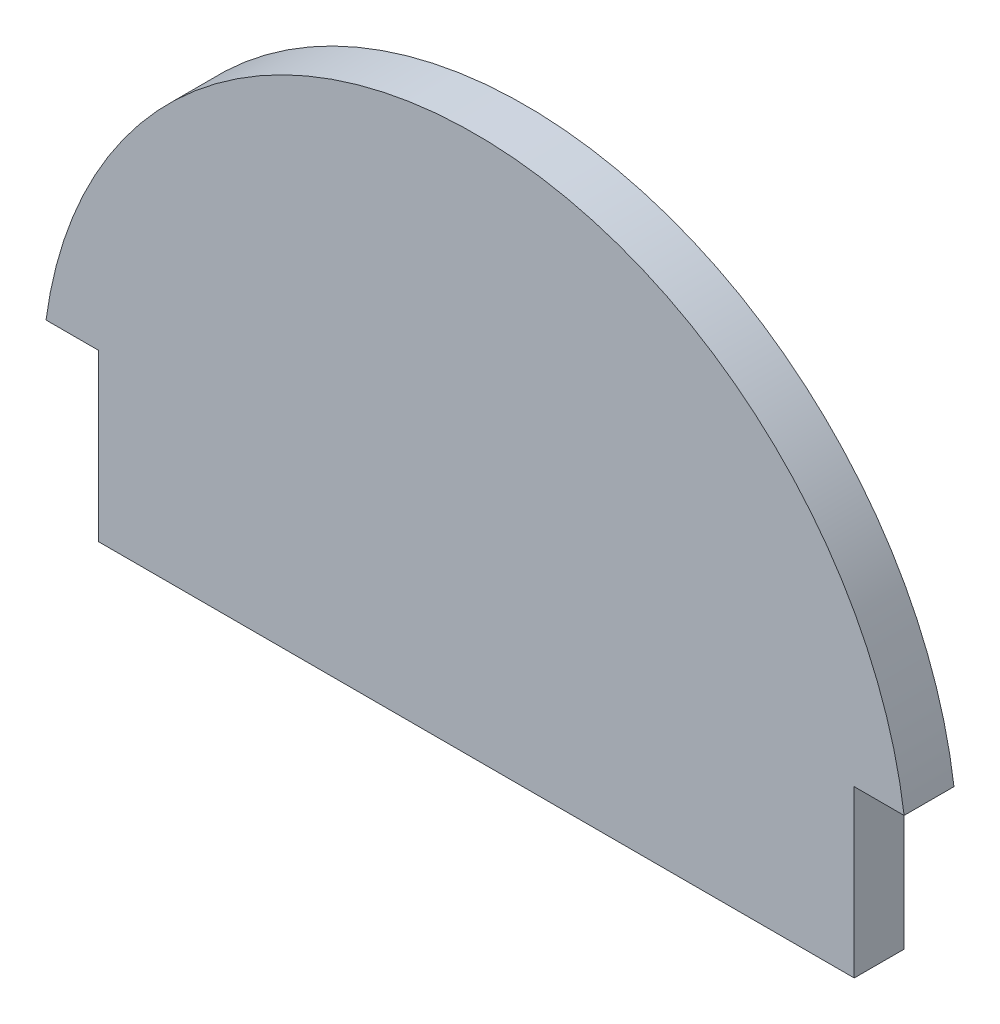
from build123d import *

# Parameters (mm, degrees)
BOSS_EXTRUDE1_DEPTH = 1.524


with BuildPart() as part:
    # Sketch1 → Boss-Extrude1 (new body)
    with BuildSketch(Plane.XY):
        with BuildLine():
            Line((0, 10.135145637), (1.605937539, 10.135145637))
            Line((1.605937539, 10.135145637), (1.605937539, 5.072055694))
            Line((1.605937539, 5.072055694), (24.693593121, 5.072055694))
            Line((24.693593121, 5.072055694), (24.693593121, 10.135145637))
            Line((24.693593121, 10.135145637), (26.217593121, 10.135145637))
            ThreePointArc((26.217593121, 10.135145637), (13.108796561, 21.617707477), (0, 10.135145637))
        make_face()
    extrude(amount=-BOSS_EXTRUDE1_DEPTH)


solid = part.part
